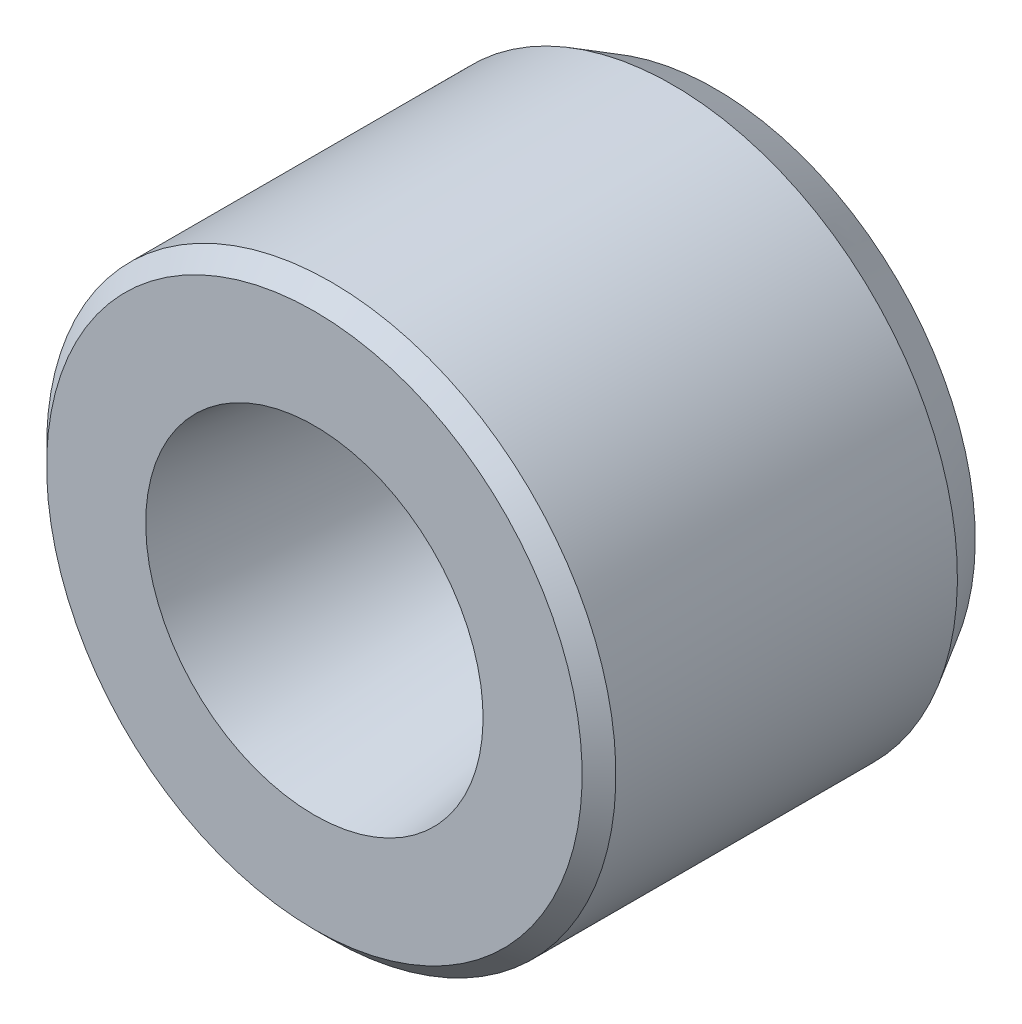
ISO-10303-21;
HEADER;
FILE_DESCRIPTION(('STEP AP214'),'2;1');
FILE_NAME('part.step','',(''),(''),'','','');
FILE_SCHEMA(('AUTOMOTIVE_DESIGN { 1 0 10303 214 1 1 1 1 }'));
ENDSEC;
DATA;
#1=APPLICATION_CONTEXT('core data for automotive mechanical design processes');
#2=APPLICATION_PROTOCOL_DEFINITION('international standard','automotive_design',2000,#1);
#3=PRODUCT_CONTEXT('',#1,'mechanical');
#4=PRODUCT('Part','Part','',(#3));
#5=PRODUCT_RELATED_PRODUCT_CATEGORY('part','',(#4));
#6=PRODUCT_DEFINITION_FORMATION('','',#4);
#7=PRODUCT_DEFINITION_CONTEXT('part definition',#1,'design');
#8=PRODUCT_DEFINITION('design','',#6,#7);
#9=PRODUCT_DEFINITION_SHAPE('','',#8);
#10=(LENGTH_UNIT() NAMED_UNIT(*) SI_UNIT(.MILLI.,.METRE.));
#11=(NAMED_UNIT(*) PLANE_ANGLE_UNIT() SI_UNIT($,.RADIAN.));
#12=(NAMED_UNIT(*) SI_UNIT($,.STERADIAN.) SOLID_ANGLE_UNIT());
#13=UNCERTAINTY_MEASURE_WITH_UNIT(LENGTH_MEASURE(1.E-05),#10,'distance_accuracy_value','');
#14=(GEOMETRIC_REPRESENTATION_CONTEXT(3) GLOBAL_UNCERTAINTY_ASSIGNED_CONTEXT((#13)) GLOBAL_UNIT_ASSIGNED_CONTEXT((#10,
#11,#12)) REPRESENTATION_CONTEXT('',''));
#15=CARTESIAN_POINT('',(0.,0.,0.));
#16=DIRECTION('',(0.,0.,1.));
#17=DIRECTION('',(1.,0.,0.));
#18=AXIS2_PLACEMENT_3D('',#15,#16,#17);
#19=CARTESIAN_POINT('',(0.,0.,5.95721388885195E-11));
#20=DIRECTION('',(0.,0.,1.));
#21=DIRECTION('',(0.,-1.,0.));
#22=AXIS2_PLACEMENT_3D('',#19,#20,#21);
#23=CONICAL_SURFACE('',#22,4.00000000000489,0.130899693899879);
#24=CARTESIAN_POINT('',(0.,0.,2.72872002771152E-12));
#25=DIRECTION('',(0.,0.,1.));
#26=DIRECTION('',(0.,-1.,0.));
#27=AXIS2_PLACEMENT_3D('',#24,#25,#26);
#28=CIRCLE('',#27,3.9999999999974);
#29=CARTESIAN_POINT('',(0.,-3.9999999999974,2.72872002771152E-12));
#30=VERTEX_POINT('',#29);
#31=EDGE_CURVE('E15',#30,#30,#28,.F.);
#32=ORIENTED_EDGE('',*,*,#31,.F.);
#33=EDGE_LOOP('',(#32));
#34=FACE_BOUND('',#33,.T.);
#35=CARTESIAN_POINT('',(0.,0.,-9.5));
#36=DIRECTION('',(0.,0.,1.));
#37=DIRECTION('',(0.,-1.,0.));
#38=AXIS2_PLACEMENT_3D('',#35,#36,#37);
#39=CIRCLE('',#38,2.74930127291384);
#40=CARTESIAN_POINT('',(0.,-2.74930127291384,-9.5));
#41=VERTEX_POINT('',#40);
#42=EDGE_CURVE('E35',#41,#41,#39,.T.);
#43=ORIENTED_EDGE('',*,*,#42,.F.);
#44=EDGE_LOOP('',(#43));
#45=FACE_BOUND('',#44,.T.);
#46=ADVANCED_FACE('F12',(#34,#45),#23,.F.);
#47=CARTESIAN_POINT('',(6.35,0.,0.));
#48=DIRECTION('',(0.,0.,1.));
#49=DIRECTION('',(0.,-1.,0.));
#50=AXIS2_PLACEMENT_3D('',#47,#48,#49);
#51=PLANE('',#50);
#52=CARTESIAN_POINT('',(0.,0.,2.72872002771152E-12));
#53=DIRECTION('',(0.,0.,-1.));
#54=DIRECTION('',(0.,1.,0.));
#55=AXIS2_PLACEMENT_3D('',#52,#53,#54);
#56=CIRCLE('',#55,6.34999999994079);
#57=CARTESIAN_POINT('',(0.,6.34999999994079,2.72872002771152E-12));
#58=VERTEX_POINT('',#57);
#59=EDGE_CURVE('E33',#58,#58,#56,.T.);
#60=ORIENTED_EDGE('',*,*,#59,.F.);
#61=EDGE_LOOP('',(#60));
#62=FACE_BOUND('',#61,.T.);
#63=ORIENTED_EDGE('',*,*,#31,.T.);
#64=EDGE_LOOP('',(#63));
#65=FACE_BOUND('',#64,.T.);
#66=ADVANCED_FACE('F42',(#62,#65),#51,.T.);
#67=CARTESIAN_POINT('',(2.74930127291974,0.,-9.5));
#68=DIRECTION('',(0.,0.,-1.));
#69=DIRECTION('',(0.,1.,0.));
#70=AXIS2_PLACEMENT_3D('',#67,#68,#69);
#71=PLANE('',#70);
#72=ORIENTED_EDGE('',*,*,#42,.T.);
#73=EDGE_LOOP('',(#72));
#74=FACE_BOUND('',#73,.T.);
#75=CARTESIAN_POINT('',(0.,0.,-9.50000000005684));
#76=DIRECTION('',(0.,0.,1.));
#77=DIRECTION('',(0.,-1.,0.));
#78=AXIS2_PLACEMENT_3D('',#75,#76,#77);
#79=CIRCLE('',#78,6.17264973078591);
#80=CARTESIAN_POINT('',(0.,-6.17264973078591,-9.50000000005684));
#81=VERTEX_POINT('',#80);
#82=EDGE_CURVE('E24',#81,#81,#79,.T.);
#83=ORIENTED_EDGE('',*,*,#82,.F.);
#84=EDGE_LOOP('',(#83));
#85=FACE_BOUND('',#84,.T.);
#86=ADVANCED_FACE('F50',(#74,#85),#71,.T.);
#87=CARTESIAN_POINT('',(0.,0.,-0.399999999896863));
#88=DIRECTION('',(0.,0.,-1.));
#89=DIRECTION('',(0.,1.,0.));
#90=AXIS2_PLACEMENT_3D('',#87,#88,#89);
#91=CONICAL_SURFACE('',#90,6.74999999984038,0.785398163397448);
#92=CARTESIAN_POINT('',(0.,0.,-0.4));
#93=DIRECTION('',(0.,0.,1.));
#94=DIRECTION('',(0.,-1.,0.));
#95=AXIS2_PLACEMENT_3D('',#92,#93,#94);
#96=CIRCLE('',#95,6.75);
#97=CARTESIAN_POINT('',(0.,-6.75,-0.4));
#98=VERTEX_POINT('',#97);
#99=EDGE_CURVE('E19',#98,#98,#96,.F.);
#100=ORIENTED_EDGE('',*,*,#99,.F.);
#101=EDGE_LOOP('',(#100));
#102=FACE_BOUND('',#101,.T.);
#103=ORIENTED_EDGE('',*,*,#59,.T.);
#104=EDGE_LOOP('',(#103));
#105=FACE_BOUND('',#104,.T.);
#106=ADVANCED_FACE('F59',(#102,#105),#91,.T.);
#107=CARTESIAN_POINT('',(0.,0.,-8.50000000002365));
#108=DIRECTION('',(0.,0.,1.));
#109=DIRECTION('',(0.,-1.,0.));
#110=AXIS2_PLACEMENT_3D('',#107,#108,#109);
#111=CONICAL_SURFACE('',#110,6.75000000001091,0.523598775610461);
#112=ORIENTED_EDGE('',*,*,#82,.T.);
#113=EDGE_LOOP('',(#112));
#114=FACE_BOUND('',#113,.T.);
#115=CARTESIAN_POINT('',(0.,0.,-8.5));
#116=DIRECTION('',(0.,0.,1.));
#117=DIRECTION('',(0.,-1.,0.));
#118=AXIS2_PLACEMENT_3D('',#115,#116,#117);
#119=CIRCLE('',#118,6.75);
#120=CARTESIAN_POINT('',(0.,-6.75,-8.5));
#121=VERTEX_POINT('',#120);
#122=EDGE_CURVE('E8',#121,#121,#119,.T.);
#123=ORIENTED_EDGE('',*,*,#122,.F.);
#124=EDGE_LOOP('',(#123));
#125=FACE_BOUND('',#124,.T.);
#126=ADVANCED_FACE('F54',(#114,#125),#111,.T.);
#127=CARTESIAN_POINT('',(0.,0.,-9.5));
#128=DIRECTION('',(0.,0.,1.));
#129=DIRECTION('',(0.,-1.,0.));
#130=AXIS2_PLACEMENT_3D('',#127,#128,#129);
#131=CYLINDRICAL_SURFACE('',#130,6.75);
#132=ORIENTED_EDGE('',*,*,#122,.T.);
#133=EDGE_LOOP('',(#132));
#134=FACE_BOUND('',#133,.T.);
#135=ORIENTED_EDGE('',*,*,#99,.T.);
#136=EDGE_LOOP('',(#135));
#137=FACE_BOUND('',#136,.T.);
#138=ADVANCED_FACE('F52',(#134,#137),#131,.T.);
#139=CLOSED_SHELL('',(#46,#66,#86,#106,#126,#138));
#140=MANIFOLD_SOLID_BREP('B1',#139);
#141=ADVANCED_BREP_SHAPE_REPRESENTATION('',(#18,#140),#14);
#142=SHAPE_DEFINITION_REPRESENTATION(#9,#141);
ENDSEC;
END-ISO-10303-21;
